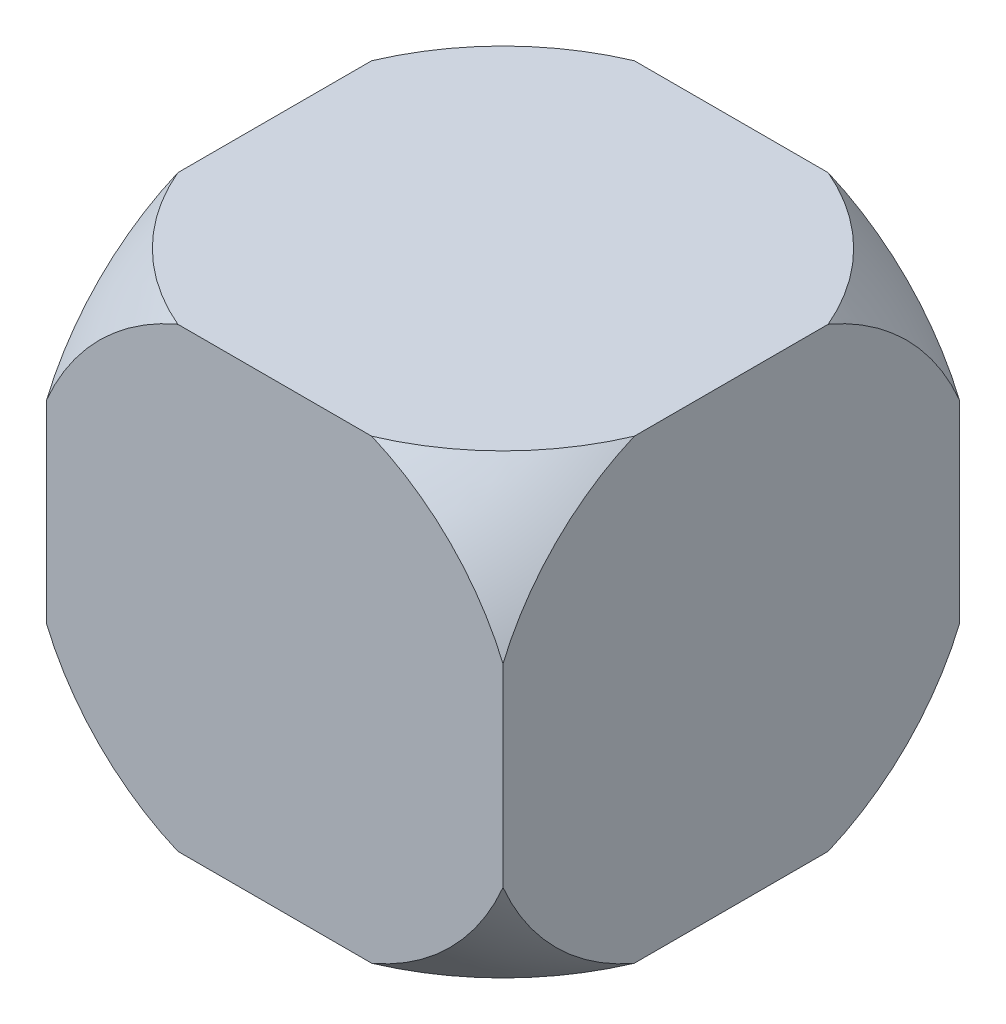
from build123d import *

# Parameters (mm, degrees)
SKIZZE1_W               = 50
SKIZZE1_H               = 50
LINEAR_AUSTRAGEN1_DEPTH = 50


with BuildPart() as part:
    # Skizze1 → Linear austragen1 (new body)
    with BuildSketch(Plane.XY):
        Rectangle(SKIZZE1_W, SKIZZE1_H)
    extrude(amount=LINEAR_AUSTRAGEN1_DEPTH)

    # Skizze6 → Schnitt-Rotation1 (revolve, cut)
    with BuildSketch(Plane.XY.offset(25)):
        with BuildLine():
            Line((0, 36.9147922), (0, 53.531514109))
            ThreePointArc((0, 53.531514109), (53.531514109, 0), (0, -53.531514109))
            Line((0, -53.531514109), (0, -36.9147922))
            ThreePointArc((0, -36.9147922), (36.9147922, 0), (0, 36.9147922))
        make_face()
    revolve(axis=Axis((0, 0, 25), (0, 1, 0)), mode=Mode.SUBTRACT)


solid = part.part
